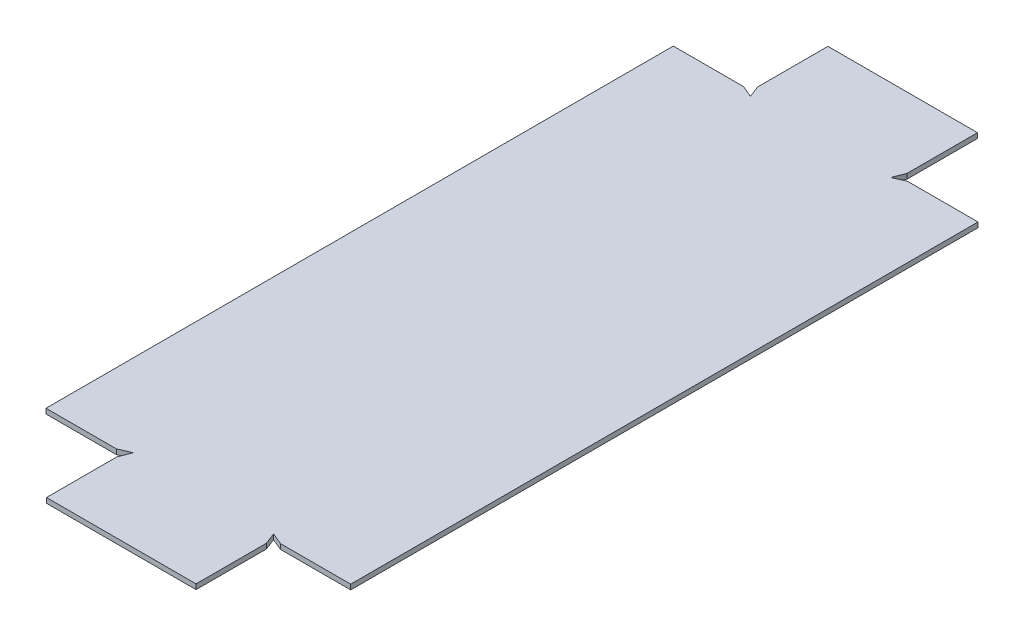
ISO-10303-21;
HEADER;
FILE_DESCRIPTION(('STEP AP214'),'2;1');
FILE_NAME('part.step','',(''),(''),'','','');
FILE_SCHEMA(('AUTOMOTIVE_DESIGN { 1 0 10303 214 1 1 1 1 }'));
ENDSEC;
DATA;
#1=APPLICATION_CONTEXT('core data for automotive mechanical design processes');
#2=APPLICATION_PROTOCOL_DEFINITION('international standard','automotive_design',2000,#1);
#3=PRODUCT_CONTEXT('',#1,'mechanical');
#4=PRODUCT('Part','Part','',(#3));
#5=PRODUCT_RELATED_PRODUCT_CATEGORY('part','',(#4));
#6=PRODUCT_DEFINITION_FORMATION('','',#4);
#7=PRODUCT_DEFINITION_CONTEXT('part definition',#1,'design');
#8=PRODUCT_DEFINITION('design','',#6,#7);
#9=PRODUCT_DEFINITION_SHAPE('','',#8);
#10=(LENGTH_UNIT() NAMED_UNIT(*) SI_UNIT(.MILLI.,.METRE.));
#11=(NAMED_UNIT(*) PLANE_ANGLE_UNIT() SI_UNIT($,.RADIAN.));
#12=(NAMED_UNIT(*) SI_UNIT($,.STERADIAN.) SOLID_ANGLE_UNIT());
#13=UNCERTAINTY_MEASURE_WITH_UNIT(LENGTH_MEASURE(1.E-05),#10,'distance_accuracy_value','');
#14=(GEOMETRIC_REPRESENTATION_CONTEXT(3) GLOBAL_UNCERTAINTY_ASSIGNED_CONTEXT((#13)) GLOBAL_UNIT_ASSIGNED_CONTEXT((#10,
#11,#12)) REPRESENTATION_CONTEXT('',''));
#15=CARTESIAN_POINT('',(0.,0.,0.));
#16=DIRECTION('',(0.,0.,1.));
#17=DIRECTION('',(1.,0.,0.));
#18=AXIS2_PLACEMENT_3D('',#15,#16,#17);
#19=CARTESIAN_POINT('',(-29.99999999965,-4.20000145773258E-09,125.));
#20=DIRECTION('',(0.,1.,0.));
#21=DIRECTION('',(-1.,0.,0.));
#22=AXIS2_PLACEMENT_3D('',#19,#20,#21);
#23=PLANE('',#22);
#24=DIRECTION('',(0.920525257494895,0.,-0.390683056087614));
#25=VECTOR('',#24,1.);
#26=CARTESIAN_POINT('',(-32.712388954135,-4.20000203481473E-09,125.));
#27=LINE('',#26,#25);
#28=CARTESIAN_POINT('',(-32.712388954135,-4.20000203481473E-09,125.));
#29=VERTEX_POINT('',#28);
#30=CARTESIAN_POINT('',(-27.99999999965,-4.20000145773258E-09,122.9999999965));
#31=VERTEX_POINT('',#30);
#32=EDGE_CURVE('E290',#29,#31,#27,.T.);
#33=ORIENTED_EDGE('',*,*,#32,.T.);
#34=DIRECTION('',(-0.356826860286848,0.,0.934170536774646));
#35=VECTOR('',#34,1.);
#36=CARTESIAN_POINT('',(-27.99999999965,-4.20000145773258E-09,123.));
#37=LINE('',#36,#35);
#38=CARTESIAN_POINT('',(-29.79999999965,-2.80001022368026E-09,127.712388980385));
#39=VERTEX_POINT('',#38);
#40=EDGE_CURVE('E283',#31,#39,#37,.T.);
#41=ORIENTED_EDGE('',*,*,#40,.T.);
#42=DIRECTION('',(0.,0.,-1.));
#43=VECTOR('',#42,1.);
#44=CARTESIAN_POINT('',(-29.79999999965,-4.19993206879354E-09,125.712388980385));
#45=LINE('',#44,#43);
#46=CARTESIAN_POINT('',(-29.79999999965,-4.20004309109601E-09,155.712388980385));
#47=VERTEX_POINT('',#46);
#48=EDGE_CURVE('E234',#47,#39,#45,.T.);
#49=ORIENTED_EDGE('',*,*,#48,.F.);
#50=DIRECTION('',(-1.,0.,0.));
#51=VECTOR('',#50,1.);
#52=CARTESIAN_POINT('',(-27.99999999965,-4.20004309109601E-09,155.712388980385));
#53=LINE('',#52,#51);
#54=CARTESIAN_POINT('',(29.80000000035,-4.20004309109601E-09,155.712388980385));
#55=VERTEX_POINT('',#54);
#56=EDGE_CURVE('E243',#55,#47,#53,.T.);
#57=ORIENTED_EDGE('',*,*,#56,.F.);
#58=DIRECTION('',(0.,0.,1.));
#59=VECTOR('',#58,1.);
#60=CARTESIAN_POINT('',(29.80000000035,-4.20004309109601E-09,155.712388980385));
#61=LINE('',#60,#59);
#62=CARTESIAN_POINT('',(29.80000000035,-4.20000145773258E-09,127.712388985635));
#63=VERTEX_POINT('',#62);
#64=EDGE_CURVE('E222',#63,#55,#61,.T.);
#65=ORIENTED_EDGE('',*,*,#64,.F.);
#66=DIRECTION('',(-0.356826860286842,0.,-0.934170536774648));
#67=VECTOR('',#66,1.);
#68=CARTESIAN_POINT('',(29.80000000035,-4.20000145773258E-09,127.712388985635));
#69=LINE('',#68,#67);
#70=CARTESIAN_POINT('',(28.00000000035,-4.20000145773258E-09,123.));
#71=VERTEX_POINT('',#70);
#72=EDGE_CURVE('E269',#63,#71,#69,.T.);
#73=ORIENTED_EDGE('',*,*,#72,.T.);
#74=DIRECTION('',(0.920525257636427,0.,0.390683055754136));
#75=VECTOR('',#74,1.);
#76=CARTESIAN_POINT('',(28.00000000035,-4.20000145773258E-09,123.));
#77=LINE('',#76,#75);
#78=CARTESIAN_POINT('',(32.7123889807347,-4.20000145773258E-09,125.));
#79=VERTEX_POINT('',#78);
#80=EDGE_CURVE('E221',#71,#79,#77,.T.);
#81=ORIENTED_EDGE('',*,*,#80,.T.);
#82=DIRECTION('',(1.,0.,0.));
#83=VECTOR('',#82,1.);
#84=CARTESIAN_POINT('',(30.7123889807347,-4.20000145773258E-09,125.));
#85=LINE('',#84,#83);
#86=CARTESIAN_POINT('',(60.7123889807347,-4.20005696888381E-09,125.));
#87=VERTEX_POINT('',#86);
#88=EDGE_CURVE('E194',#79,#87,#85,.T.);
#89=ORIENTED_EDGE('',*,*,#88,.T.);
#90=DIRECTION('',(0.,0.,-1.));
#91=VECTOR('',#90,1.);
#92=CARTESIAN_POINT('',(60.7123889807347,-4.20005696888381E-09,125.));
#93=LINE('',#92,#91);
#94=CARTESIAN_POINT('',(60.7123889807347,-4.2000292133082E-09,-125.));
#95=VERTEX_POINT('',#94);
#96=EDGE_CURVE('E185',#87,#95,#93,.T.);
#97=ORIENTED_EDGE('',*,*,#96,.T.);
#98=DIRECTION('',(1.,0.,0.));
#99=VECTOR('',#98,1.);
#100=CARTESIAN_POINT('',(30.7123889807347,-4.19998757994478E-09,-125.));
#101=LINE('',#100,#99);
#102=CARTESIAN_POINT('',(32.7123889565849,-4.20000088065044E-09,-125.));
#103=VERTEX_POINT('',#102);
#104=EDGE_CURVE('E331',#103,#95,#101,.T.);
#105=ORIENTED_EDGE('',*,*,#104,.F.);
#106=DIRECTION('',(-0.92052525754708,0.,0.390683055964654));
#107=VECTOR('',#106,1.);
#108=CARTESIAN_POINT('',(32.7123889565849,-4.20000088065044E-09,-125.));
#109=LINE('',#108,#107);
#110=CARTESIAN_POINT('',(28.00000000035,-4.20000145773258E-09,-122.9999999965));
#111=VERTEX_POINT('',#110);
#112=EDGE_CURVE('E303',#103,#111,#109,.T.);
#113=ORIENTED_EDGE('',*,*,#112,.T.);
#114=DIRECTION('',(0.356826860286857,0.,-0.934170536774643));
#115=VECTOR('',#114,1.);
#116=CARTESIAN_POINT('',(28.00000000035,-4.20000145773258E-09,-123.));
#117=LINE('',#116,#115);
#118=CARTESIAN_POINT('',(29.80000000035,-2.80001022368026E-09,-127.712388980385));
#119=VERTEX_POINT('',#118);
#120=EDGE_CURVE('E274',#111,#119,#117,.T.);
#121=ORIENTED_EDGE('',*,*,#120,.T.);
#122=DIRECTION('',(0.,0.,-1.));
#123=VECTOR('',#122,1.);
#124=CARTESIAN_POINT('',(29.80000000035,-4.20009860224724E-09,-155.712388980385));
#125=LINE('',#124,#123);
#126=CARTESIAN_POINT('',(29.80000000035,-4.20009860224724E-09,-155.712388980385));
#127=VERTEX_POINT('',#126);
#128=EDGE_CURVE('E256',#119,#127,#125,.T.);
#129=ORIENTED_EDGE('',*,*,#128,.T.);
#130=DIRECTION('',(-1.,0.,0.));
#131=VECTOR('',#130,1.);
#132=CARTESIAN_POINT('',(-28.,-4.20009860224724E-09,-155.712388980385));
#133=LINE('',#132,#131);
#134=CARTESIAN_POINT('',(-29.8,-4.20009860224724E-09,-155.712388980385));
#135=VERTEX_POINT('',#134);
#136=EDGE_CURVE('E262',#127,#135,#133,.T.);
#137=ORIENTED_EDGE('',*,*,#136,.T.);
#138=DIRECTION('',(0.,0.,1.));
#139=VECTOR('',#138,1.);
#140=CARTESIAN_POINT('',(-29.8,-4.19998757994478E-09,-125.712388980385));
#141=LINE('',#140,#139);
#142=CARTESIAN_POINT('',(-29.7999999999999,-4.20000145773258E-09,-127.712388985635));
#143=VERTEX_POINT('',#142);
#144=EDGE_CURVE('E259',#135,#143,#141,.T.);
#145=ORIENTED_EDGE('',*,*,#144,.T.);
#146=DIRECTION('',(0.356826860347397,0.,0.934170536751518));
#147=VECTOR('',#146,1.);
#148=CARTESIAN_POINT('',(-29.8,-4.20000145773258E-09,-127.712388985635));
#149=LINE('',#148,#147);
#150=CARTESIAN_POINT('',(-27.99999999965,-4.20000145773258E-09,-123.));
#151=VERTEX_POINT('',#150);
#152=EDGE_CURVE('E270',#143,#151,#149,.T.);
#153=ORIENTED_EDGE('',*,*,#152,.T.);
#154=DIRECTION('',(-0.920525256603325,0.,-0.390683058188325));
#155=VECTOR('',#154,1.);
#156=CARTESIAN_POINT('',(-27.99999999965,-4.20000145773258E-09,-123.));
#157=LINE('',#156,#155);
#158=CARTESIAN_POINT('',(-32.7123889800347,-4.19997370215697E-09,-125.));
#159=VERTEX_POINT('',#158);
#160=EDGE_CURVE('E245',#151,#159,#157,.T.);
#161=ORIENTED_EDGE('',*,*,#160,.T.);
#162=DIRECTION('',(1.,0.,0.));
#163=VECTOR('',#162,1.);
#164=CARTESIAN_POINT('',(-60.7123889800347,-4.19997023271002E-09,-125.));
#165=LINE('',#164,#163);
#166=CARTESIAN_POINT('',(-60.7123889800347,-4.19997023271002E-09,-125.));
#167=VERTEX_POINT('',#166);
#168=EDGE_CURVE('E211',#167,#159,#165,.T.);
#169=ORIENTED_EDGE('',*,*,#168,.F.);
#170=DIRECTION('',(0.,0.,-1.));
#171=VECTOR('',#170,1.);
#172=CARTESIAN_POINT('',(-60.7123889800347,-4.19999798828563E-09,125.));
#173=LINE('',#172,#171);
#174=CARTESIAN_POINT('',(-60.7123889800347,-4.19999798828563E-09,125.));
#175=VERTEX_POINT('',#174);
#176=EDGE_CURVE('E216',#175,#167,#173,.T.);
#177=ORIENTED_EDGE('',*,*,#176,.F.);
#178=DIRECTION('',(1.,0.,0.));
#179=VECTOR('',#178,1.);
#180=CARTESIAN_POINT('',(-60.7123889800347,-4.19999798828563E-09,125.));
#181=LINE('',#180,#179);
#182=EDGE_CURVE('E213',#175,#29,#181,.T.);
#183=ORIENTED_EDGE('',*,*,#182,.T.);
#184=EDGE_LOOP('',(#33,#41,#49,#57,#65,#73,#81,#89,#97,#105,#113,#121,#129,#137,#145,#153,#161,
#169,#177,#183));
#185=FACE_BOUND('',#184,.T.);
#186=ADVANCED_FACE('F34',(#185),#23,.T.);
#187=CARTESIAN_POINT('',(-29.99999999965,-2.0000000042,125.));
#188=DIRECTION('',(0.,1.,0.));
#189=DIRECTION('',(-1.,0.,0.));
#190=AXIS2_PLACEMENT_3D('',#187,#188,#189);
#191=PLANE('',#190);
#192=DIRECTION('',(-0.920525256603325,0.,-0.390683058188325));
#193=VECTOR('',#192,1.);
#194=CARTESIAN_POINT('',(-27.99999999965,-2.0000000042,-123.));
#195=LINE('',#194,#193);
#196=CARTESIAN_POINT('',(-27.99999999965,-2.00000000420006,-123.));
#197=VERTEX_POINT('',#196);
#198=CARTESIAN_POINT('',(-32.7123889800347,-2.00000000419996,-125.));
#199=VERTEX_POINT('',#198);
#200=EDGE_CURVE('E294',#197,#199,#195,.T.);
#201=ORIENTED_EDGE('',*,*,#200,.F.);
#202=DIRECTION('',(0.356826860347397,0.,0.934170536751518));
#203=VECTOR('',#202,1.);
#204=CARTESIAN_POINT('',(-29.8,-2.0000000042,-127.712388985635));
#205=LINE('',#204,#203);
#206=CARTESIAN_POINT('',(-29.7999999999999,-2.0000000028,-127.712388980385));
#207=VERTEX_POINT('',#206);
#208=EDGE_CURVE('E275',#207,#197,#205,.T.);
#209=ORIENTED_EDGE('',*,*,#208,.F.);
#210=DIRECTION('',(0.,0.,1.));
#211=VECTOR('',#210,1.);
#212=CARTESIAN_POINT('',(-29.8,-2.00000000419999,-125.712388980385));
#213=LINE('',#212,#211);
#214=CARTESIAN_POINT('',(-29.8,-2.0000000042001,-155.712388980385));
#215=VERTEX_POINT('',#214);
#216=EDGE_CURVE('E246',#215,#207,#213,.T.);
#217=ORIENTED_EDGE('',*,*,#216,.F.);
#218=DIRECTION('',(-1.,0.,0.));
#219=VECTOR('',#218,1.);
#220=CARTESIAN_POINT('',(-28.,-2.0000000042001,-155.712388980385));
#221=LINE('',#220,#219);
#222=CARTESIAN_POINT('',(29.80000000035,-2.0000000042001,-155.712388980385));
#223=VERTEX_POINT('',#222);
#224=EDGE_CURVE('E267',#223,#215,#221,.T.);
#225=ORIENTED_EDGE('',*,*,#224,.F.);
#226=DIRECTION('',(0.,0.,-1.));
#227=VECTOR('',#226,1.);
#228=CARTESIAN_POINT('',(29.80000000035,-2.0000000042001,-155.712388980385));
#229=LINE('',#228,#227);
#230=CARTESIAN_POINT('',(29.80000000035,-2.00000000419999,-127.712388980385));
#231=VERTEX_POINT('',#230);
#232=EDGE_CURVE('E252',#231,#223,#229,.T.);
#233=ORIENTED_EDGE('',*,*,#232,.F.);
#234=DIRECTION('',(0.356826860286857,0.,-0.934170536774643));
#235=VECTOR('',#234,1.);
#236=CARTESIAN_POINT('',(28.00000000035,-2.0000000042,-123.));
#237=LINE('',#236,#235);
#238=CARTESIAN_POINT('',(28.00000000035,-2.00000000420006,-123.));
#239=VERTEX_POINT('',#238);
#240=EDGE_CURVE('E50',#239,#231,#237,.T.);
#241=ORIENTED_EDGE('',*,*,#240,.F.);
#242=DIRECTION('',(-0.92052525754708,0.,0.390683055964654));
#243=VECTOR('',#242,1.);
#244=CARTESIAN_POINT('',(32.7123889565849,-2.0000000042,-125.));
#245=LINE('',#244,#243);
#246=CARTESIAN_POINT('',(32.7123889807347,-2.00000000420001,-125.));
#247=VERTEX_POINT('',#246);
#248=EDGE_CURVE('E308',#247,#239,#245,.T.);
#249=ORIENTED_EDGE('',*,*,#248,.F.);
#250=DIRECTION('',(1.,0.,0.));
#251=VECTOR('',#250,1.);
#252=CARTESIAN_POINT('',(30.7123889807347,-2.00000000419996,-125.));
#253=LINE('',#252,#251);
#254=CARTESIAN_POINT('',(60.7123889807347,-2.00000000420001,-125.));
#255=VERTEX_POINT('',#254);
#256=EDGE_CURVE('E184',#247,#255,#253,.T.);
#257=ORIENTED_EDGE('',*,*,#256,.T.);
#258=DIRECTION('',(0.,0.,-1.));
#259=VECTOR('',#258,1.);
#260=CARTESIAN_POINT('',(60.7123889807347,-2.00000000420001,125.));
#261=LINE('',#260,#259);
#262=CARTESIAN_POINT('',(60.7123889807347,-2.00000000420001,125.));
#263=VERTEX_POINT('',#262);
#264=EDGE_CURVE('E188',#263,#255,#261,.T.);
#265=ORIENTED_EDGE('',*,*,#264,.F.);
#266=DIRECTION('',(1.,0.,0.));
#267=VECTOR('',#266,1.);
#268=CARTESIAN_POINT('',(30.7123889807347,-2.00000000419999,125.));
#269=LINE('',#268,#267);
#270=CARTESIAN_POINT('',(32.7123889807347,-2.00000000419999,125.));
#271=VERTEX_POINT('',#270);
#272=EDGE_CURVE('E175',#271,#263,#269,.T.);
#273=ORIENTED_EDGE('',*,*,#272,.F.);
#274=DIRECTION('',(0.920525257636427,0.,0.390683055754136));
#275=VECTOR('',#274,1.);
#276=CARTESIAN_POINT('',(28.00000000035,-2.0000000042,123.));
#277=LINE('',#276,#275);
#278=CARTESIAN_POINT('',(28.00000000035,-2.00000002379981,123.));
#279=VERTEX_POINT('',#278);
#280=EDGE_CURVE('E307',#279,#271,#277,.T.);
#281=ORIENTED_EDGE('',*,*,#280,.F.);
#282=DIRECTION('',(-0.356826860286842,0.,-0.934170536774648));
#283=VECTOR('',#282,1.);
#284=CARTESIAN_POINT('',(29.80000000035,-2.0000000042,127.712388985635));
#285=LINE('',#284,#283);
#286=CARTESIAN_POINT('',(29.80000000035,-2.0000000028,127.712388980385));
#287=VERTEX_POINT('',#286);
#288=EDGE_CURVE('E58',#287,#279,#285,.T.);
#289=ORIENTED_EDGE('',*,*,#288,.F.);
#290=DIRECTION('',(0.,0.,1.));
#291=VECTOR('',#290,1.);
#292=CARTESIAN_POINT('',(29.80000000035,-2.00000000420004,155.712388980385));
#293=LINE('',#292,#291);
#294=CARTESIAN_POINT('',(29.80000000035,-2.00000000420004,155.712388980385));
#295=VERTEX_POINT('',#294);
#296=EDGE_CURVE('E231',#287,#295,#293,.T.);
#297=ORIENTED_EDGE('',*,*,#296,.T.);
#298=DIRECTION('',(-1.,0.,0.));
#299=VECTOR('',#298,1.);
#300=CARTESIAN_POINT('',(-27.99999999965,-2.00000000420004,155.712388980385));
#301=LINE('',#300,#299);
#302=CARTESIAN_POINT('',(-29.79999999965,-2.00000000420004,155.712388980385));
#303=VERTEX_POINT('',#302);
#304=EDGE_CURVE('E229',#295,#303,#301,.T.);
#305=ORIENTED_EDGE('',*,*,#304,.T.);
#306=DIRECTION('',(0.,0.,-1.));
#307=VECTOR('',#306,1.);
#308=CARTESIAN_POINT('',(-29.79999999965,-2.00000000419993,125.712388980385));
#309=LINE('',#308,#307);
#310=CARTESIAN_POINT('',(-29.79999999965,-2.00000000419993,127.712388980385));
#311=VERTEX_POINT('',#310);
#312=EDGE_CURVE('E227',#303,#311,#309,.T.);
#313=ORIENTED_EDGE('',*,*,#312,.T.);
#314=DIRECTION('',(-0.356826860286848,0.,0.934170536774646));
#315=VECTOR('',#314,1.);
#316=CARTESIAN_POINT('',(-27.99999999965,-2.0000000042,123.));
#317=LINE('',#316,#315);
#318=CARTESIAN_POINT('',(-27.99999999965,-2.0000000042,123.));
#319=VERTEX_POINT('',#318);
#320=EDGE_CURVE('E225',#319,#311,#317,.T.);
#321=ORIENTED_EDGE('',*,*,#320,.F.);
#322=DIRECTION('',(0.920525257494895,0.,-0.390683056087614));
#323=VECTOR('',#322,1.);
#324=CARTESIAN_POINT('',(-32.712388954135,-2.0000000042,125.));
#325=LINE('',#324,#323);
#326=CARTESIAN_POINT('',(-32.7123889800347,-2.00000000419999,125.));
#327=VERTEX_POINT('',#326);
#328=EDGE_CURVE('E295',#327,#319,#325,.T.);
#329=ORIENTED_EDGE('',*,*,#328,.F.);
#330=DIRECTION('',(1.,0.,0.));
#331=VECTOR('',#330,1.);
#332=CARTESIAN_POINT('',(-60.7123889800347,-2.00000000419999,125.));
#333=LINE('',#332,#331);
#334=CARTESIAN_POINT('',(-60.7123889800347,-2.00000000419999,125.));
#335=VERTEX_POINT('',#334);
#336=EDGE_CURVE('E200',#335,#327,#333,.T.);
#337=ORIENTED_EDGE('',*,*,#336,.F.);
#338=DIRECTION('',(0.,0.,-1.));
#339=VECTOR('',#338,1.);
#340=CARTESIAN_POINT('',(-60.7123889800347,-2.00000000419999,125.));
#341=LINE('',#340,#339);
#342=CARTESIAN_POINT('',(-60.7123889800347,-2.00000000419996,-125.));
#343=VERTEX_POINT('',#342);
#344=EDGE_CURVE('E203',#335,#343,#341,.T.);
#345=ORIENTED_EDGE('',*,*,#344,.T.);
#346=DIRECTION('',(1.,0.,0.));
#347=VECTOR('',#346,1.);
#348=CARTESIAN_POINT('',(-60.7123889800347,-2.00000000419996,-125.));
#349=LINE('',#348,#347);
#350=EDGE_CURVE('E205',#343,#199,#349,.T.);
#351=ORIENTED_EDGE('',*,*,#350,.T.);
#352=EDGE_LOOP('',(#201,#209,#217,#225,#233,#241,#249,#257,#265,#273,#281,#289,#297,#305,#313,
#321,#329,#337,#345,#351));
#353=FACE_BOUND('',#352,.T.);
#354=ADVANCED_FACE('F190',(#353),#191,.F.);
#355=CARTESIAN_POINT('',(28.00000000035,-4.20000145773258E-09,-123.));
#356=DIRECTION('',(0.934170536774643,0.,0.356826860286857));
#357=DIRECTION('',(0.356826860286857,0.,-0.934170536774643));
#358=AXIS2_PLACEMENT_3D('',#355,#356,#357);
#359=PLANE('',#358);
#360=DIRECTION('',(0.,1.,0.));
#361=VECTOR('',#360,1.);
#362=CARTESIAN_POINT('',(28.00000000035,-4.20000145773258E-09,-122.9999999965));
#363=LINE('',#362,#361);
#364=EDGE_CURVE('E11',#239,#111,#363,.T.);
#365=ORIENTED_EDGE('',*,*,#364,.F.);
#366=ORIENTED_EDGE('',*,*,#240,.T.);
#367=DIRECTION('',(0.,1.,0.));
#368=VECTOR('',#367,1.);
#369=CARTESIAN_POINT('',(29.80000000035,-4.20000145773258E-09,-127.712388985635));
#370=LINE('',#369,#368);
#371=EDGE_CURVE('E255',#231,#119,#370,.T.);
#372=ORIENTED_EDGE('',*,*,#371,.T.);
#373=ORIENTED_EDGE('',*,*,#120,.F.);
#374=EDGE_LOOP('',(#365,#366,#372,#373));
#375=FACE_BOUND('',#374,.T.);
#376=ADVANCED_FACE('F400',(#375),#359,.T.);
#377=CARTESIAN_POINT('',(-29.8,-4.20000145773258E-09,-127.712388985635));
#378=DIRECTION('',(-0.934170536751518,0.,0.356826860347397));
#379=DIRECTION('',(0.356826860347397,0.,0.934170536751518));
#380=AXIS2_PLACEMENT_3D('',#377,#378,#379);
#381=PLANE('',#380);
#382=ORIENTED_EDGE('',*,*,#208,.T.);
#383=DIRECTION('',(0.,1.,0.));
#384=VECTOR('',#383,1.);
#385=CARTESIAN_POINT('',(-27.99999999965,-4.20000145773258E-09,-123.));
#386=LINE('',#385,#384);
#387=EDGE_CURVE('E273',#197,#151,#386,.T.);
#388=ORIENTED_EDGE('',*,*,#387,.T.);
#389=ORIENTED_EDGE('',*,*,#152,.F.);
#390=DIRECTION('',(0.,1.,0.));
#391=VECTOR('',#390,1.);
#392=CARTESIAN_POINT('',(-29.8,-2.0000000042,-127.712388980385));
#393=LINE('',#392,#391);
#394=EDGE_CURVE('E248',#207,#143,#393,.T.);
#395=ORIENTED_EDGE('',*,*,#394,.F.);
#396=EDGE_LOOP('',(#382,#388,#389,#395));
#397=FACE_BOUND('',#396,.T.);
#398=ADVANCED_FACE('F388',(#397),#381,.T.);
#399=CARTESIAN_POINT('',(-28.,-2.0000000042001,-155.712388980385));
#400=DIRECTION('',(0.,0.,-1.));
#401=DIRECTION('',(0.,1.,0.));
#402=AXIS2_PLACEMENT_3D('',#399,#400,#401);
#403=PLANE('',#402);
#404=ORIENTED_EDGE('',*,*,#136,.F.);
#405=DIRECTION('',(0.,1.,0.));
#406=VECTOR('',#405,1.);
#407=CARTESIAN_POINT('',(29.80000000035,-2.0000000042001,-155.712388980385));
#408=LINE('',#407,#406);
#409=EDGE_CURVE('E249',#223,#127,#408,.T.);
#410=ORIENTED_EDGE('',*,*,#409,.F.);
#411=ORIENTED_EDGE('',*,*,#224,.T.);
#412=DIRECTION('',(0.,1.,0.));
#413=VECTOR('',#412,1.);
#414=CARTESIAN_POINT('',(-29.8,-2.0000000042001,-155.712388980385));
#415=LINE('',#414,#413);
#416=EDGE_CURVE('E264',#215,#135,#415,.T.);
#417=ORIENTED_EDGE('',*,*,#416,.T.);
#418=EDGE_LOOP('',(#404,#410,#411,#417));
#419=FACE_BOUND('',#418,.T.);
#420=ADVANCED_FACE('F395',(#419),#403,.T.);
#421=CARTESIAN_POINT('',(29.80000000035,-2.0000000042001,-155.712388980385));
#422=DIRECTION('',(1.,0.,0.));
#423=DIRECTION('',(0.,0.,-1.));
#424=AXIS2_PLACEMENT_3D('',#421,#422,#423);
#425=PLANE('',#424);
#426=ORIENTED_EDGE('',*,*,#128,.F.);
#427=ORIENTED_EDGE('',*,*,#371,.F.);
#428=ORIENTED_EDGE('',*,*,#232,.T.);
#429=ORIENTED_EDGE('',*,*,#409,.T.);
#430=EDGE_LOOP('',(#426,#427,#428,#429));
#431=FACE_BOUND('',#430,.T.);
#432=ADVANCED_FACE('F397',(#431),#425,.T.);
#433=CARTESIAN_POINT('',(-29.8,-2.00000000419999,-125.712388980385));
#434=DIRECTION('',(-1.,0.,0.));
#435=DIRECTION('',(0.,1.,0.));
#436=AXIS2_PLACEMENT_3D('',#433,#434,#435);
#437=PLANE('',#436);
#438=ORIENTED_EDGE('',*,*,#216,.T.);
#439=ORIENTED_EDGE('',*,*,#394,.T.);
#440=ORIENTED_EDGE('',*,*,#144,.F.);
#441=ORIENTED_EDGE('',*,*,#416,.F.);
#442=EDGE_LOOP('',(#438,#439,#440,#441));
#443=FACE_BOUND('',#442,.T.);
#444=ADVANCED_FACE('F392',(#443),#437,.T.);
#445=CARTESIAN_POINT('',(-27.99999999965,-4.20000145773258E-09,123.));
#446=DIRECTION('',(-0.934170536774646,0.,-0.356826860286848));
#447=DIRECTION('',(-0.356826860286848,0.,0.934170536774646));
#448=AXIS2_PLACEMENT_3D('',#445,#446,#447);
#449=PLANE('',#448);
#450=DIRECTION('',(0.,1.,0.));
#451=VECTOR('',#450,1.);
#452=CARTESIAN_POINT('',(-27.99999999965,-4.20000145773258E-09,122.9999999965));
#453=LINE('',#452,#451);
#454=EDGE_CURVE('E317',#319,#31,#453,.T.);
#455=ORIENTED_EDGE('',*,*,#454,.F.);
#456=ORIENTED_EDGE('',*,*,#320,.T.);
#457=DIRECTION('',(0.,1.,0.));
#458=VECTOR('',#457,1.);
#459=CARTESIAN_POINT('',(-29.79999999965,-4.20000145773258E-09,127.712388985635));
#460=LINE('',#459,#458);
#461=EDGE_CURVE('E239',#311,#39,#460,.T.);
#462=ORIENTED_EDGE('',*,*,#461,.T.);
#463=ORIENTED_EDGE('',*,*,#40,.F.);
#464=EDGE_LOOP('',(#455,#456,#462,#463));
#465=FACE_BOUND('',#464,.T.);
#466=ADVANCED_FACE('F362',(#465),#449,.T.);
#467=CARTESIAN_POINT('',(29.80000000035,-4.20000145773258E-09,127.712388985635));
#468=DIRECTION('',(0.934170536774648,0.,-0.356826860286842));
#469=DIRECTION('',(-0.356826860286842,0.,-0.934170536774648));
#470=AXIS2_PLACEMENT_3D('',#467,#468,#469);
#471=PLANE('',#470);
#472=ORIENTED_EDGE('',*,*,#288,.T.);
#473=DIRECTION('',(0.,1.,0.));
#474=VECTOR('',#473,1.);
#475=CARTESIAN_POINT('',(28.00000000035,-4.20000145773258E-09,123.));
#476=LINE('',#475,#474);
#477=EDGE_CURVE('E42',#279,#71,#476,.T.);
#478=ORIENTED_EDGE('',*,*,#477,.T.);
#479=ORIENTED_EDGE('',*,*,#72,.F.);
#480=DIRECTION('',(0.,-1.,0.));
#481=VECTOR('',#480,1.);
#482=CARTESIAN_POINT('',(29.80000000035,-2.00000000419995,127.712388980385));
#483=LINE('',#482,#481);
#484=EDGE_CURVE('E226',#287,#63,#483,.F.);
#485=ORIENTED_EDGE('',*,*,#484,.F.);
#486=EDGE_LOOP('',(#472,#478,#479,#485));
#487=FACE_BOUND('',#486,.T.);
#488=ADVANCED_FACE('F350',(#487),#471,.T.);
#489=CARTESIAN_POINT('',(-27.99999999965,-2.00000000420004,155.712388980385));
#490=DIRECTION('',(0.,0.,-1.));
#491=DIRECTION('',(0.,1.,0.));
#492=AXIS2_PLACEMENT_3D('',#489,#490,#491);
#493=PLANE('',#492);
#494=ORIENTED_EDGE('',*,*,#56,.T.);
#495=DIRECTION('',(0.,1.,0.));
#496=VECTOR('',#495,1.);
#497=CARTESIAN_POINT('',(-29.79999999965,-2.00000000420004,155.712388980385));
#498=LINE('',#497,#496);
#499=EDGE_CURVE('E236',#303,#47,#498,.T.);
#500=ORIENTED_EDGE('',*,*,#499,.F.);
#501=ORIENTED_EDGE('',*,*,#304,.F.);
#502=DIRECTION('',(0.,1.,0.));
#503=VECTOR('',#502,1.);
#504=CARTESIAN_POINT('',(29.80000000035,-2.00000000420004,155.712388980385));
#505=LINE('',#504,#503);
#506=EDGE_CURVE('E240',#295,#55,#505,.T.);
#507=ORIENTED_EDGE('',*,*,#506,.T.);
#508=EDGE_LOOP('',(#494,#500,#501,#507));
#509=FACE_BOUND('',#508,.T.);
#510=ADVANCED_FACE('F353',(#509),#493,.F.);
#511=CARTESIAN_POINT('',(-29.79999999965,-2.00000000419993,125.712388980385));
#512=DIRECTION('',(1.,0.,0.));
#513=DIRECTION('',(0.,1.,0.));
#514=AXIS2_PLACEMENT_3D('',#511,#512,#513);
#515=PLANE('',#514);
#516=ORIENTED_EDGE('',*,*,#461,.F.);
#517=ORIENTED_EDGE('',*,*,#312,.F.);
#518=ORIENTED_EDGE('',*,*,#499,.T.);
#519=ORIENTED_EDGE('',*,*,#48,.T.);
#520=EDGE_LOOP('',(#516,#517,#518,#519));
#521=FACE_BOUND('',#520,.T.);
#522=ADVANCED_FACE('F357',(#521),#515,.F.);
#523=CARTESIAN_POINT('',(29.80000000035,-2.00000000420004,155.712388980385));
#524=DIRECTION('',(-1.,0.,0.));
#525=DIRECTION('',(0.,0.,-1.));
#526=AXIS2_PLACEMENT_3D('',#523,#524,#525);
#527=PLANE('',#526);
#528=ORIENTED_EDGE('',*,*,#484,.T.);
#529=ORIENTED_EDGE('',*,*,#64,.T.);
#530=ORIENTED_EDGE('',*,*,#506,.F.);
#531=ORIENTED_EDGE('',*,*,#296,.F.);
#532=EDGE_LOOP('',(#528,#529,#530,#531));
#533=FACE_BOUND('',#532,.T.);
#534=ADVANCED_FACE('F347',(#533),#527,.F.);
#535=CARTESIAN_POINT('',(-32.712388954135,-4.20000203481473E-09,125.));
#536=DIRECTION('',(0.390683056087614,0.,0.920525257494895));
#537=DIRECTION('',(0.920525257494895,0.,-0.390683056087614));
#538=AXIS2_PLACEMENT_3D('',#535,#536,#537);
#539=PLANE('',#538);
#540=DIRECTION('',(0.,-1.,0.));
#541=VECTOR('',#540,1.);
#542=CARTESIAN_POINT('',(-32.7123889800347,57.9999999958,125.));
#543=LINE('',#542,#541);
#544=EDGE_CURVE('E202',#327,#29,#543,.F.);
#545=ORIENTED_EDGE('',*,*,#544,.F.);
#546=ORIENTED_EDGE('',*,*,#328,.T.);
#547=ORIENTED_EDGE('',*,*,#454,.T.);
#548=ORIENTED_EDGE('',*,*,#32,.F.);
#549=EDGE_LOOP('',(#545,#546,#547,#548));
#550=FACE_BOUND('',#549,.T.);
#551=ADVANCED_FACE('F366',(#550),#539,.T.);
#552=CARTESIAN_POINT('',(-27.99999999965,-4.20000145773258E-09,-123.));
#553=DIRECTION('',(0.390683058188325,0.,-0.920525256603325));
#554=DIRECTION('',(-0.920525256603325,0.,-0.390683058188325));
#555=AXIS2_PLACEMENT_3D('',#552,#553,#554);
#556=PLANE('',#555);
#557=ORIENTED_EDGE('',*,*,#200,.T.);
#558=DIRECTION('',(0.,1.,0.));
#559=VECTOR('',#558,1.);
#560=CARTESIAN_POINT('',(-32.7123889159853,-4.20000203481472E-09,-125.));
#561=LINE('',#560,#559);
#562=EDGE_CURVE('E210',#199,#159,#561,.T.);
#563=ORIENTED_EDGE('',*,*,#562,.T.);
#564=ORIENTED_EDGE('',*,*,#160,.F.);
#565=ORIENTED_EDGE('',*,*,#387,.F.);
#566=EDGE_LOOP('',(#557,#563,#564,#565));
#567=FACE_BOUND('',#566,.T.);
#568=ADVANCED_FACE('F382',(#567),#556,.T.);
#569=CARTESIAN_POINT('',(-60.7123889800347,-2.00000000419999,125.));
#570=DIRECTION('',(-1.,0.,0.));
#571=DIRECTION('',(0.,0.,1.));
#572=AXIS2_PLACEMENT_3D('',#569,#570,#571);
#573=PLANE('',#572);
#574=DIRECTION('',(0.,1.,0.));
#575=VECTOR('',#574,1.);
#576=CARTESIAN_POINT('',(-60.7123889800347,-2.00000000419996,-125.));
#577=LINE('',#576,#575);
#578=EDGE_CURVE('E207',#343,#167,#577,.T.);
#579=ORIENTED_EDGE('',*,*,#578,.F.);
#580=ORIENTED_EDGE('',*,*,#344,.F.);
#581=DIRECTION('',(0.,1.,0.));
#582=VECTOR('',#581,1.);
#583=CARTESIAN_POINT('',(-60.7123889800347,-2.00000000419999,125.));
#584=LINE('',#583,#582);
#585=EDGE_CURVE('E218',#335,#175,#584,.T.);
#586=ORIENTED_EDGE('',*,*,#585,.T.);
#587=ORIENTED_EDGE('',*,*,#176,.T.);
#588=EDGE_LOOP('',(#579,#580,#586,#587));
#589=FACE_BOUND('',#588,.T.);
#590=ADVANCED_FACE('F374',(#589),#573,.T.);
#591=CARTESIAN_POINT('',(-28.7123889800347,1.99999999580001,-125.));
#592=DIRECTION('',(0.,0.,-1.));
#593=DIRECTION('',(0.,-1.,0.));
#594=AXIS2_PLACEMENT_3D('',#591,#592,#593);
#595=PLANE('',#594);
#596=ORIENTED_EDGE('',*,*,#168,.T.);
#597=ORIENTED_EDGE('',*,*,#562,.F.);
#598=ORIENTED_EDGE('',*,*,#350,.F.);
#599=ORIENTED_EDGE('',*,*,#578,.T.);
#600=EDGE_LOOP('',(#596,#597,#598,#599));
#601=FACE_BOUND('',#600,.T.);
#602=ADVANCED_FACE('F378',(#601),#595,.T.);
#603=CARTESIAN_POINT('',(-32.7123889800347,57.9999999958,125.));
#604=DIRECTION('',(0.,0.,-1.));
#605=DIRECTION('',(0.,-1.,0.));
#606=AXIS2_PLACEMENT_3D('',#603,#604,#605);
#607=PLANE('',#606);
#608=ORIENTED_EDGE('',*,*,#336,.T.);
#609=ORIENTED_EDGE('',*,*,#544,.T.);
#610=ORIENTED_EDGE('',*,*,#182,.F.);
#611=ORIENTED_EDGE('',*,*,#585,.F.);
#612=EDGE_LOOP('',(#608,#609,#610,#611));
#613=FACE_BOUND('',#612,.T.);
#614=ADVANCED_FACE('F369',(#613),#607,.F.);
#615=CARTESIAN_POINT('',(32.7123889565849,-4.20000088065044E-09,-125.));
#616=DIRECTION('',(-0.390683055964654,0.,-0.92052525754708));
#617=DIRECTION('',(-0.92052525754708,0.,0.390683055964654));
#618=AXIS2_PLACEMENT_3D('',#615,#616,#617);
#619=PLANE('',#618);
#620=DIRECTION('',(0.,1.,0.));
#621=VECTOR('',#620,1.);
#622=CARTESIAN_POINT('',(32.7123889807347,1.9999999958,-125.));
#623=LINE('',#622,#621);
#624=EDGE_CURVE('E330',#247,#103,#623,.T.);
#625=ORIENTED_EDGE('',*,*,#624,.F.);
#626=ORIENTED_EDGE('',*,*,#248,.T.);
#627=ORIENTED_EDGE('',*,*,#364,.T.);
#628=ORIENTED_EDGE('',*,*,#112,.F.);
#629=EDGE_LOOP('',(#625,#626,#627,#628));
#630=FACE_BOUND('',#629,.T.);
#631=ADVANCED_FACE('F403',(#630),#619,.T.);
#632=CARTESIAN_POINT('',(28.00000000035,-4.20000145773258E-09,123.));
#633=DIRECTION('',(-0.390683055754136,0.,0.920525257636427));
#634=DIRECTION('',(0.920525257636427,0.,0.390683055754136));
#635=AXIS2_PLACEMENT_3D('',#632,#633,#634);
#636=PLANE('',#635);
#637=ORIENTED_EDGE('',*,*,#280,.T.);
#638=DIRECTION('',(0.,1.,0.));
#639=VECTOR('',#638,1.);
#640=CARTESIAN_POINT('',(32.712388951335,-4.20000088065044E-09,125.));
#641=LINE('',#640,#639);
#642=EDGE_CURVE('E37',#271,#79,#641,.T.);
#643=ORIENTED_EDGE('',*,*,#642,.T.);
#644=ORIENTED_EDGE('',*,*,#80,.F.);
#645=ORIENTED_EDGE('',*,*,#477,.F.);
#646=EDGE_LOOP('',(#637,#643,#644,#645));
#647=FACE_BOUND('',#646,.T.);
#648=ADVANCED_FACE('F343',(#647),#636,.T.);
#649=CARTESIAN_POINT('',(60.7123889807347,-4.20005696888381E-09,125.));
#650=DIRECTION('',(1.,0.,0.));
#651=DIRECTION('',(0.,0.,1.));
#652=AXIS2_PLACEMENT_3D('',#649,#650,#651);
#653=PLANE('',#652);
#654=DIRECTION('',(0.,-1.,0.));
#655=VECTOR('',#654,1.);
#656=CARTESIAN_POINT('',(60.7123889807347,-4.2000292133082E-09,-125.));
#657=LINE('',#656,#655);
#658=EDGE_CURVE('E311',#95,#255,#657,.T.);
#659=ORIENTED_EDGE('',*,*,#658,.F.);
#660=ORIENTED_EDGE('',*,*,#96,.F.);
#661=DIRECTION('',(0.,-1.,0.));
#662=VECTOR('',#661,1.);
#663=CARTESIAN_POINT('',(60.7123889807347,-4.20005696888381E-09,125.));
#664=LINE('',#663,#662);
#665=EDGE_CURVE('E179',#87,#263,#664,.T.);
#666=ORIENTED_EDGE('',*,*,#665,.T.);
#667=ORIENTED_EDGE('',*,*,#264,.T.);
#668=EDGE_LOOP('',(#659,#660,#666,#667));
#669=FACE_BOUND('',#668,.T.);
#670=ADVANCED_FACE('F196',(#669),#653,.T.);
#671=CARTESIAN_POINT('',(28.7123889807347,1.9999999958,125.));
#672=DIRECTION('',(0.,0.,1.));
#673=DIRECTION('',(0.,-1.,0.));
#674=AXIS2_PLACEMENT_3D('',#671,#672,#673);
#675=PLANE('',#674);
#676=ORIENTED_EDGE('',*,*,#88,.F.);
#677=ORIENTED_EDGE('',*,*,#642,.F.);
#678=ORIENTED_EDGE('',*,*,#272,.T.);
#679=ORIENTED_EDGE('',*,*,#665,.F.);
#680=EDGE_LOOP('',(#676,#677,#678,#679));
#681=FACE_BOUND('',#680,.T.);
#682=ADVANCED_FACE('F177',(#681),#675,.T.);
#683=CARTESIAN_POINT('',(32.7123889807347,1.9999999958,-125.));
#684=DIRECTION('',(0.,0.,-1.));
#685=DIRECTION('',(0.,1.,0.));
#686=AXIS2_PLACEMENT_3D('',#683,#684,#685);
#687=PLANE('',#686);
#688=ORIENTED_EDGE('',*,*,#256,.F.);
#689=ORIENTED_EDGE('',*,*,#624,.T.);
#690=ORIENTED_EDGE('',*,*,#104,.T.);
#691=ORIENTED_EDGE('',*,*,#658,.T.);
#692=EDGE_LOOP('',(#688,#689,#690,#691));
#693=FACE_BOUND('',#692,.T.);
#694=ADVANCED_FACE('F404',(#693),#687,.T.);
#695=CLOSED_SHELL('',(#186,#354,#376,#398,#420,#432,#444,#466,#488,#510,#522,#534,#551,#568,
#590,#602,#614,#631,#648,#670,#682,#694));
#696=MANIFOLD_SOLID_BREP('B2',#695);
#697=ADVANCED_BREP_SHAPE_REPRESENTATION('',(#18,#696),#14);
#698=SHAPE_DEFINITION_REPRESENTATION(#9,#697);
ENDSEC;
END-ISO-10303-21;
